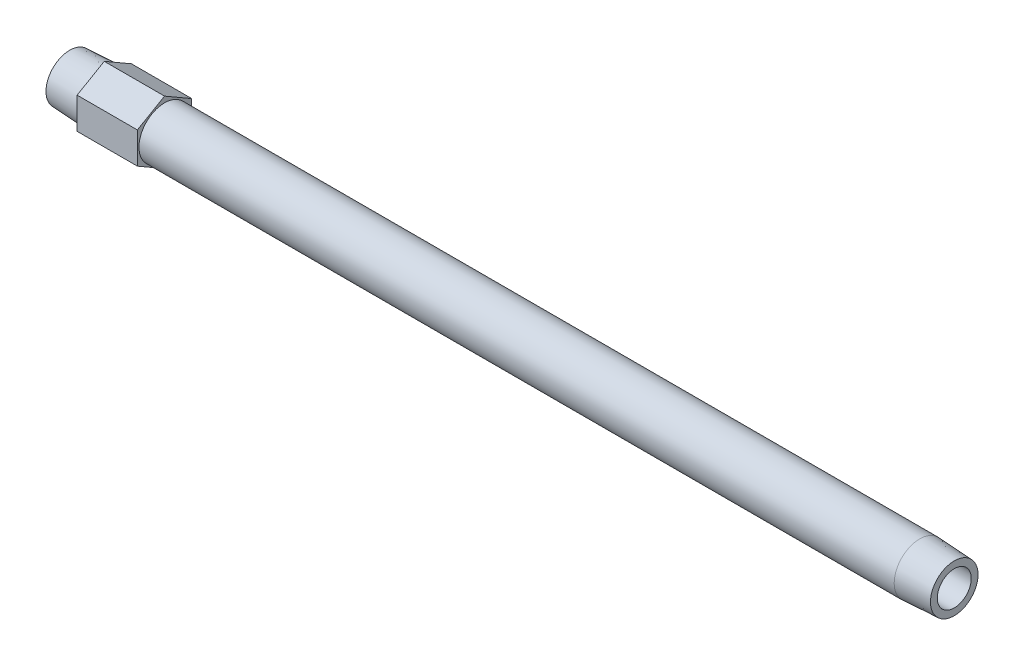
ISO-10303-21;
HEADER;
FILE_DESCRIPTION(('STEP AP214'),'2;1');
FILE_NAME('part.step','',(''),(''),'','','');
FILE_SCHEMA(('AUTOMOTIVE_DESIGN { 1 0 10303 214 1 1 1 1 }'));
ENDSEC;
DATA;
#1=APPLICATION_CONTEXT('core data for automotive mechanical design processes');
#2=APPLICATION_PROTOCOL_DEFINITION('international standard','automotive_design',2000,#1);
#3=PRODUCT_CONTEXT('',#1,'mechanical');
#4=PRODUCT('Part','Part','',(#3));
#5=PRODUCT_RELATED_PRODUCT_CATEGORY('part','',(#4));
#6=PRODUCT_DEFINITION_FORMATION('','',#4);
#7=PRODUCT_DEFINITION_CONTEXT('part definition',#1,'design');
#8=PRODUCT_DEFINITION('design','',#6,#7);
#9=PRODUCT_DEFINITION_SHAPE('','',#8);
#10=(LENGTH_UNIT() NAMED_UNIT(*) SI_UNIT(.MILLI.,.METRE.));
#11=(NAMED_UNIT(*) PLANE_ANGLE_UNIT() SI_UNIT($,.RADIAN.));
#12=(NAMED_UNIT(*) SI_UNIT($,.STERADIAN.) SOLID_ANGLE_UNIT());
#13=UNCERTAINTY_MEASURE_WITH_UNIT(LENGTH_MEASURE(1.E-05),#10,'distance_accuracy_value','');
#14=(GEOMETRIC_REPRESENTATION_CONTEXT(3) GLOBAL_UNCERTAINTY_ASSIGNED_CONTEXT((#13)) GLOBAL_UNIT_ASSIGNED_CONTEXT((#10,
#11,#12)) REPRESENTATION_CONTEXT('',''));
#15=CARTESIAN_POINT('',(0.,0.,0.));
#16=DIRECTION('',(0.,0.,1.));
#17=DIRECTION('',(1.,0.,0.));
#18=AXIS2_PLACEMENT_3D('',#15,#16,#17);
#19=CARTESIAN_POINT('',(0.,0.,-4.78009397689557));
#20=DIRECTION('',(1.,0.,0.));
#21=DIRECTION('',(0.,0.,-1.));
#22=AXIS2_PLACEMENT_3D('',#19,#20,#21);
#23=PLANE('',#22);
#24=CARTESIAN_POINT('',(0.,0.,0.));
#25=DIRECTION('',(-1.,0.,0.));
#26=DIRECTION('',(0.,0.,1.));
#27=AXIS2_PLACEMENT_3D('',#24,#25,#26);
#28=CIRCLE('',#27,4.78009397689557);
#29=CARTESIAN_POINT('',(0.,0.,4.78009397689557));
#30=VERTEX_POINT('',#29);
#31=EDGE_CURVE('E147',#30,#30,#28,.T.);
#32=ORIENTED_EDGE('',*,*,#31,.T.);
#33=EDGE_LOOP('',(#32));
#34=FACE_BOUND('',#33,.T.);
#35=CARTESIAN_POINT('',(0.,0.,0.));
#36=DIRECTION('',(1.,0.,0.));
#37=DIRECTION('',(0.,0.,1.));
#38=AXIS2_PLACEMENT_3D('',#35,#36,#37);
#39=CIRCLE('',#38,3.4163);
#40=CARTESIAN_POINT('',(0.,0.,3.4163));
#41=VERTEX_POINT('',#40);
#42=EDGE_CURVE('E159',#41,#41,#39,.T.);
#43=ORIENTED_EDGE('',*,*,#42,.T.);
#44=EDGE_LOOP('',(#43));
#45=FACE_BOUND('',#44,.T.);
#46=ADVANCED_FACE('F15',(#34,#45),#23,.F.);
#47=CARTESIAN_POINT('',(177.8,0.,-4.78009397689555));
#48=DIRECTION('',(-1.,0.,0.));
#49=DIRECTION('',(0.,0.,1.));
#50=AXIS2_PLACEMENT_3D('',#47,#48,#49);
#51=PLANE('',#50);
#52=CARTESIAN_POINT('',(177.8,0.,0.));
#53=DIRECTION('',(-1.,0.,0.));
#54=DIRECTION('',(0.,0.,1.));
#55=AXIS2_PLACEMENT_3D('',#52,#53,#54);
#56=CIRCLE('',#55,4.78009397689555);
#57=CARTESIAN_POINT('',(177.8,0.,4.78009397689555));
#58=VERTEX_POINT('',#57);
#59=EDGE_CURVE('E150',#58,#58,#56,.T.);
#60=ORIENTED_EDGE('',*,*,#59,.F.);
#61=EDGE_LOOP('',(#60));
#62=FACE_BOUND('',#61,.T.);
#63=CARTESIAN_POINT('',(177.8,0.,0.));
#64=DIRECTION('',(-1.,0.,0.));
#65=DIRECTION('',(0.,0.,1.));
#66=AXIS2_PLACEMENT_3D('',#63,#64,#65);
#67=CIRCLE('',#66,3.4163);
#68=CARTESIAN_POINT('',(177.8,0.,3.4163));
#69=VERTEX_POINT('',#68);
#70=EDGE_CURVE('E156',#69,#69,#67,.F.);
#71=ORIENTED_EDGE('',*,*,#70,.F.);
#72=EDGE_LOOP('',(#71));
#73=FACE_BOUND('',#72,.T.);
#74=ADVANCED_FACE('F178',(#62,#73),#51,.F.);
#75=CARTESIAN_POINT('',(19.05,-9.45872946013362,5.461));
#76=DIRECTION('',(-1.,0.,0.));
#77=DIRECTION('',(0.,-1.,0.));
#78=AXIS2_PLACEMENT_3D('',#75,#76,#77);
#79=PLANE('',#78);
#80=DIRECTION('',(0.,0.5,-0.866025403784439));
#81=VECTOR('',#80,1.);
#82=CARTESIAN_POINT('',(19.05,-6.30581964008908,0.));
#83=LINE('',#82,#81);
#84=CARTESIAN_POINT('',(19.05,-6.30581964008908,0.));
#85=VERTEX_POINT('',#84);
#86=CARTESIAN_POINT('',(19.05,-3.15290982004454,-5.461));
#87=VERTEX_POINT('',#86);
#88=EDGE_CURVE('E103',#85,#87,#83,.T.);
#89=ORIENTED_EDGE('',*,*,#88,.T.);
#90=DIRECTION('',(0.,1.,0.));
#91=VECTOR('',#90,1.);
#92=CARTESIAN_POINT('',(19.05,-3.15290982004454,-5.461));
#93=LINE('',#92,#91);
#94=CARTESIAN_POINT('',(19.05,3.15290982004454,-5.461));
#95=VERTEX_POINT('',#94);
#96=EDGE_CURVE('E83',#87,#95,#93,.T.);
#97=ORIENTED_EDGE('',*,*,#96,.T.);
#98=DIRECTION('',(0.,0.5,0.866025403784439));
#99=VECTOR('',#98,1.);
#100=CARTESIAN_POINT('',(19.05,3.15290982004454,-5.461));
#101=LINE('',#100,#99);
#102=CARTESIAN_POINT('',(19.05,6.30581964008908,0.));
#103=VERTEX_POINT('',#102);
#104=EDGE_CURVE('E102',#95,#103,#101,.T.);
#105=ORIENTED_EDGE('',*,*,#104,.T.);
#106=DIRECTION('',(0.,-0.5,0.866025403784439));
#107=VECTOR('',#106,1.);
#108=CARTESIAN_POINT('',(19.05,6.30581964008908,0.));
#109=LINE('',#108,#107);
#110=CARTESIAN_POINT('',(19.05,3.15290982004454,5.461));
#111=VERTEX_POINT('',#110);
#112=EDGE_CURVE('E105',#103,#111,#109,.T.);
#113=ORIENTED_EDGE('',*,*,#112,.T.);
#114=DIRECTION('',(0.,-1.,0.));
#115=VECTOR('',#114,1.);
#116=CARTESIAN_POINT('',(19.05,3.15290982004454,5.461));
#117=LINE('',#116,#115);
#118=CARTESIAN_POINT('',(19.05,-3.15290982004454,5.461));
#119=VERTEX_POINT('',#118);
#120=EDGE_CURVE('E35',#111,#119,#117,.T.);
#121=ORIENTED_EDGE('',*,*,#120,.T.);
#122=DIRECTION('',(0.,-0.5,-0.866025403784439));
#123=VECTOR('',#122,1.);
#124=CARTESIAN_POINT('',(19.05,-3.15290982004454,5.461));
#125=LINE('',#124,#123);
#126=EDGE_CURVE('E30',#119,#85,#125,.T.);
#127=ORIENTED_EDGE('',*,*,#126,.T.);
#128=EDGE_LOOP('',(#89,#97,#105,#113,#121,#127));
#129=FACE_BOUND('',#128,.T.);
#130=CARTESIAN_POINT('',(19.05,0.,0.));
#131=DIRECTION('',(-1.,0.,0.));
#132=DIRECTION('',(0.,-1.,0.));
#133=AXIS2_PLACEMENT_3D('',#130,#131,#132);
#134=CIRCLE('',#133,5.1435);
#135=CARTESIAN_POINT('',(19.05,-5.1435,0.));
#136=VERTEX_POINT('',#135);
#137=EDGE_CURVE('E89',#136,#136,#134,.F.);
#138=ORIENTED_EDGE('',*,*,#137,.F.);
#139=EDGE_LOOP('',(#138));
#140=FACE_BOUND('',#139,.T.);
#141=ADVANCED_FACE('F124',(#129,#140),#79,.F.);
#142=CARTESIAN_POINT('',(6.9342,-9.45872946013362,5.461));
#143=DIRECTION('',(-1.,0.,0.));
#144=DIRECTION('',(0.,-1.,0.));
#145=AXIS2_PLACEMENT_3D('',#142,#143,#144);
#146=PLANE('',#145);
#147=DIRECTION('',(0.,0.5,-0.866025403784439));
#148=VECTOR('',#147,1.);
#149=CARTESIAN_POINT('',(6.9342,-6.30581964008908,0.));
#150=LINE('',#149,#148);
#151=CARTESIAN_POINT('',(6.9342,-6.30581964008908,0.));
#152=VERTEX_POINT('',#151);
#153=CARTESIAN_POINT('',(6.9342,-3.15290982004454,-5.461));
#154=VERTEX_POINT('',#153);
#155=EDGE_CURVE('E73',#152,#154,#150,.T.);
#156=ORIENTED_EDGE('',*,*,#155,.F.);
#157=DIRECTION('',(0.,-0.5,-0.866025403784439));
#158=VECTOR('',#157,1.);
#159=CARTESIAN_POINT('',(6.9342,-3.15290982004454,5.461));
#160=LINE('',#159,#158);
#161=CARTESIAN_POINT('',(6.9342,-3.15290982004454,5.461));
#162=VERTEX_POINT('',#161);
#163=EDGE_CURVE('E99',#162,#152,#160,.T.);
#164=ORIENTED_EDGE('',*,*,#163,.F.);
#165=DIRECTION('',(0.,-1.,0.));
#166=VECTOR('',#165,1.);
#167=CARTESIAN_POINT('',(6.9342,3.15290982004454,5.461));
#168=LINE('',#167,#166);
#169=CARTESIAN_POINT('',(6.9342,3.15290982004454,5.461));
#170=VERTEX_POINT('',#169);
#171=EDGE_CURVE('E133',#170,#162,#168,.T.);
#172=ORIENTED_EDGE('',*,*,#171,.F.);
#173=DIRECTION('',(0.,-0.5,0.866025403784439));
#174=VECTOR('',#173,1.);
#175=CARTESIAN_POINT('',(6.9342,6.30581964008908,0.));
#176=LINE('',#175,#174);
#177=CARTESIAN_POINT('',(6.9342,6.30581964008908,0.));
#178=VERTEX_POINT('',#177);
#179=EDGE_CURVE('E129',#178,#170,#176,.T.);
#180=ORIENTED_EDGE('',*,*,#179,.F.);
#181=DIRECTION('',(0.,0.5,0.866025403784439));
#182=VECTOR('',#181,1.);
#183=CARTESIAN_POINT('',(6.9342,3.15290982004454,-5.461));
#184=LINE('',#183,#182);
#185=CARTESIAN_POINT('',(6.9342,3.15290982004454,-5.461));
#186=VERTEX_POINT('',#185);
#187=EDGE_CURVE('E75',#186,#178,#184,.T.);
#188=ORIENTED_EDGE('',*,*,#187,.F.);
#189=DIRECTION('',(0.,1.,0.));
#190=VECTOR('',#189,1.);
#191=CARTESIAN_POINT('',(6.9342,-3.15290982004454,-5.461));
#192=LINE('',#191,#190);
#193=EDGE_CURVE('E68',#154,#186,#192,.T.);
#194=ORIENTED_EDGE('',*,*,#193,.F.);
#195=EDGE_LOOP('',(#156,#164,#172,#180,#188,#194));
#196=FACE_BOUND('',#195,.T.);
#197=CARTESIAN_POINT('',(6.9342,0.,0.));
#198=DIRECTION('',(-1.,0.,0.));
#199=DIRECTION('',(0.,0.,1.));
#200=AXIS2_PLACEMENT_3D('',#197,#198,#199);
#201=CIRCLE('',#200,5.1435);
#202=CARTESIAN_POINT('',(6.9342,0.,5.1435));
#203=VERTEX_POINT('',#202);
#204=EDGE_CURVE('E95',#203,#203,#201,.T.);
#205=ORIENTED_EDGE('',*,*,#204,.F.);
#206=EDGE_LOOP('',(#205));
#207=FACE_BOUND('',#206,.T.);
#208=ADVANCED_FACE('F69',(#196,#207),#146,.T.);
#209=CARTESIAN_POINT('',(19.05,-6.30581964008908,0.));
#210=DIRECTION('',(0.,0.866025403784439,0.5));
#211=DIRECTION('',(0.,-0.5,0.866025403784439));
#212=AXIS2_PLACEMENT_3D('',#209,#210,#211);
#213=PLANE('',#212);
#214=ORIENTED_EDGE('',*,*,#155,.T.);
#215=DIRECTION('',(-1.,0.,0.));
#216=VECTOR('',#215,1.);
#217=CARTESIAN_POINT('',(19.05,-3.15290982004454,-5.461));
#218=LINE('',#217,#216);
#219=EDGE_CURVE('E10',#87,#154,#218,.T.);
#220=ORIENTED_EDGE('',*,*,#219,.F.);
#221=ORIENTED_EDGE('',*,*,#88,.F.);
#222=DIRECTION('',(-1.,0.,0.));
#223=VECTOR('',#222,1.);
#224=CARTESIAN_POINT('',(19.05,-6.30581964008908,0.));
#225=LINE('',#224,#223);
#226=EDGE_CURVE('E87',#85,#152,#225,.T.);
#227=ORIENTED_EDGE('',*,*,#226,.T.);
#228=EDGE_LOOP('',(#214,#220,#221,#227));
#229=FACE_BOUND('',#228,.T.);
#230=ADVANCED_FACE('F17',(#229),#213,.F.);
#231=CARTESIAN_POINT('',(19.05,-3.15290982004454,-5.461));
#232=DIRECTION('',(0.,0.,1.));
#233=DIRECTION('',(0.,-1.,0.));
#234=AXIS2_PLACEMENT_3D('',#231,#232,#233);
#235=PLANE('',#234);
#236=ORIENTED_EDGE('',*,*,#193,.T.);
#237=DIRECTION('',(-1.,0.,0.));
#238=VECTOR('',#237,1.);
#239=CARTESIAN_POINT('',(19.05,3.15290982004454,-5.461));
#240=LINE('',#239,#238);
#241=EDGE_CURVE('E23',#95,#186,#240,.T.);
#242=ORIENTED_EDGE('',*,*,#241,.F.);
#243=ORIENTED_EDGE('',*,*,#96,.F.);
#244=ORIENTED_EDGE('',*,*,#219,.T.);
#245=EDGE_LOOP('',(#236,#242,#243,#244));
#246=FACE_BOUND('',#245,.T.);
#247=ADVANCED_FACE('F82',(#246),#235,.F.);
#248=CARTESIAN_POINT('',(19.05,3.15290982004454,-5.461));
#249=DIRECTION('',(0.,-0.866025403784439,0.5));
#250=DIRECTION('',(0.,-0.5,-0.866025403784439));
#251=AXIS2_PLACEMENT_3D('',#248,#249,#250);
#252=PLANE('',#251);
#253=ORIENTED_EDGE('',*,*,#187,.T.);
#254=DIRECTION('',(-1.,0.,0.));
#255=VECTOR('',#254,1.);
#256=CARTESIAN_POINT('',(19.05,6.30581964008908,0.));
#257=LINE('',#256,#255);
#258=EDGE_CURVE('E117',#103,#178,#257,.T.);
#259=ORIENTED_EDGE('',*,*,#258,.F.);
#260=ORIENTED_EDGE('',*,*,#104,.F.);
#261=ORIENTED_EDGE('',*,*,#241,.T.);
#262=EDGE_LOOP('',(#253,#259,#260,#261));
#263=FACE_BOUND('',#262,.T.);
#264=ADVANCED_FACE('F121',(#263),#252,.F.);
#265=CARTESIAN_POINT('',(19.05,6.30581964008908,0.));
#266=DIRECTION('',(0.,-0.866025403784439,-0.5));
#267=DIRECTION('',(0.,0.5,-0.866025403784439));
#268=AXIS2_PLACEMENT_3D('',#265,#266,#267);
#269=PLANE('',#268);
#270=ORIENTED_EDGE('',*,*,#179,.T.);
#271=DIRECTION('',(-1.,0.,0.));
#272=VECTOR('',#271,1.);
#273=CARTESIAN_POINT('',(19.05,3.15290982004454,5.461));
#274=LINE('',#273,#272);
#275=EDGE_CURVE('E114',#111,#170,#274,.T.);
#276=ORIENTED_EDGE('',*,*,#275,.F.);
#277=ORIENTED_EDGE('',*,*,#112,.F.);
#278=ORIENTED_EDGE('',*,*,#258,.T.);
#279=EDGE_LOOP('',(#270,#276,#277,#278));
#280=FACE_BOUND('',#279,.T.);
#281=ADVANCED_FACE('F128',(#280),#269,.F.);
#282=CARTESIAN_POINT('',(19.05,3.15290982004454,5.461));
#283=DIRECTION('',(0.,0.,-1.));
#284=DIRECTION('',(-1.,0.,0.));
#285=AXIS2_PLACEMENT_3D('',#282,#283,#284);
#286=PLANE('',#285);
#287=ORIENTED_EDGE('',*,*,#171,.T.);
#288=DIRECTION('',(-1.,0.,0.));
#289=VECTOR('',#288,1.);
#290=CARTESIAN_POINT('',(19.05,-3.15290982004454,5.461));
#291=LINE('',#290,#289);
#292=EDGE_CURVE('E111',#119,#162,#291,.T.);
#293=ORIENTED_EDGE('',*,*,#292,.F.);
#294=ORIENTED_EDGE('',*,*,#120,.F.);
#295=ORIENTED_EDGE('',*,*,#275,.T.);
#296=EDGE_LOOP('',(#287,#293,#294,#295));
#297=FACE_BOUND('',#296,.T.);
#298=ADVANCED_FACE('F132',(#297),#286,.F.);
#299=CARTESIAN_POINT('',(19.05,-3.15290982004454,5.461));
#300=DIRECTION('',(0.,0.866025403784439,-0.5));
#301=DIRECTION('',(0.,0.5,0.866025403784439));
#302=AXIS2_PLACEMENT_3D('',#299,#300,#301);
#303=PLANE('',#302);
#304=ORIENTED_EDGE('',*,*,#163,.T.);
#305=ORIENTED_EDGE('',*,*,#226,.F.);
#306=ORIENTED_EDGE('',*,*,#126,.F.);
#307=ORIENTED_EDGE('',*,*,#292,.T.);
#308=EDGE_LOOP('',(#304,#305,#306,#307));
#309=FACE_BOUND('',#308,.T.);
#310=ADVANCED_FACE('F135',(#309),#303,.F.);
#311=CARTESIAN_POINT('',(6.9342,0.,0.));
#312=DIRECTION('',(1.,0.,0.));
#313=DIRECTION('',(0.,0.,-1.));
#314=AXIS2_PLACEMENT_3D('',#311,#312,#313);
#315=CONICAL_SURFACE('',#314,5.1435,0.0523598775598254);
#316=ORIENTED_EDGE('',*,*,#31,.F.);
#317=EDGE_LOOP('',(#316));
#318=FACE_BOUND('',#317,.T.);
#319=ORIENTED_EDGE('',*,*,#204,.T.);
#320=EDGE_LOOP('',(#319));
#321=FACE_BOUND('',#320,.T.);
#322=ADVANCED_FACE('F187',(#318,#321),#315,.T.);
#323=CARTESIAN_POINT('',(-60.,0.,0.));
#324=DIRECTION('',(-1.,0.,0.));
#325=DIRECTION('',(0.,0.,1.));
#326=AXIS2_PLACEMENT_3D('',#323,#324,#325);
#327=CYLINDRICAL_SURFACE('',#326,5.1435);
#328=ORIENTED_EDGE('',*,*,#137,.T.);
#329=EDGE_LOOP('',(#328));
#330=FACE_BOUND('',#329,.T.);
#331=CARTESIAN_POINT('',(170.8658,0.,0.));
#332=DIRECTION('',(-1.,0.,0.));
#333=DIRECTION('',(0.,0.,1.));
#334=AXIS2_PLACEMENT_3D('',#331,#332,#333);
#335=CIRCLE('',#334,5.1435);
#336=CARTESIAN_POINT('',(170.8658,0.,5.1435));
#337=VERTEX_POINT('',#336);
#338=EDGE_CURVE('E153',#337,#337,#335,.T.);
#339=ORIENTED_EDGE('',*,*,#338,.T.);
#340=EDGE_LOOP('',(#339));
#341=FACE_BOUND('',#340,.T.);
#342=ADVANCED_FACE('F174',(#330,#341),#327,.T.);
#343=CARTESIAN_POINT('',(177.8,0.,0.));
#344=DIRECTION('',(-1.,0.,0.));
#345=DIRECTION('',(0.,0.,1.));
#346=AXIS2_PLACEMENT_3D('',#343,#344,#345);
#347=CONICAL_SURFACE('',#346,4.78009397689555,0.0523598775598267);
#348=ORIENTED_EDGE('',*,*,#338,.F.);
#349=EDGE_LOOP('',(#348));
#350=FACE_BOUND('',#349,.T.);
#351=ORIENTED_EDGE('',*,*,#59,.T.);
#352=EDGE_LOOP('',(#351));
#353=FACE_BOUND('',#352,.T.);
#354=ADVANCED_FACE('F167',(#350,#353),#347,.T.);
#355=CARTESIAN_POINT('',(178.581027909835,0.,0.));
#356=DIRECTION('',(-1.,0.,0.));
#357=DIRECTION('',(0.,0.,1.));
#358=AXIS2_PLACEMENT_3D('',#355,#356,#357);
#359=CYLINDRICAL_SURFACE('',#358,3.4163);
#360=ORIENTED_EDGE('',*,*,#70,.T.);
#361=EDGE_LOOP('',(#360));
#362=FACE_BOUND('',#361,.T.);
#363=ORIENTED_EDGE('',*,*,#42,.F.);
#364=EDGE_LOOP('',(#363));
#365=FACE_BOUND('',#364,.T.);
#366=ADVANCED_FACE('F165',(#362,#365),#359,.F.);
#367=CLOSED_SHELL('',(#46,#74,#141,#208,#230,#247,#264,#281,#298,#310,#322,#342,#354,#366));
#368=MANIFOLD_SOLID_BREP('B1',#367);
#369=ADVANCED_BREP_SHAPE_REPRESENTATION('',(#18,#368),#14);
#370=SHAPE_DEFINITION_REPRESENTATION(#9,#369);
ENDSEC;
END-ISO-10303-21;
